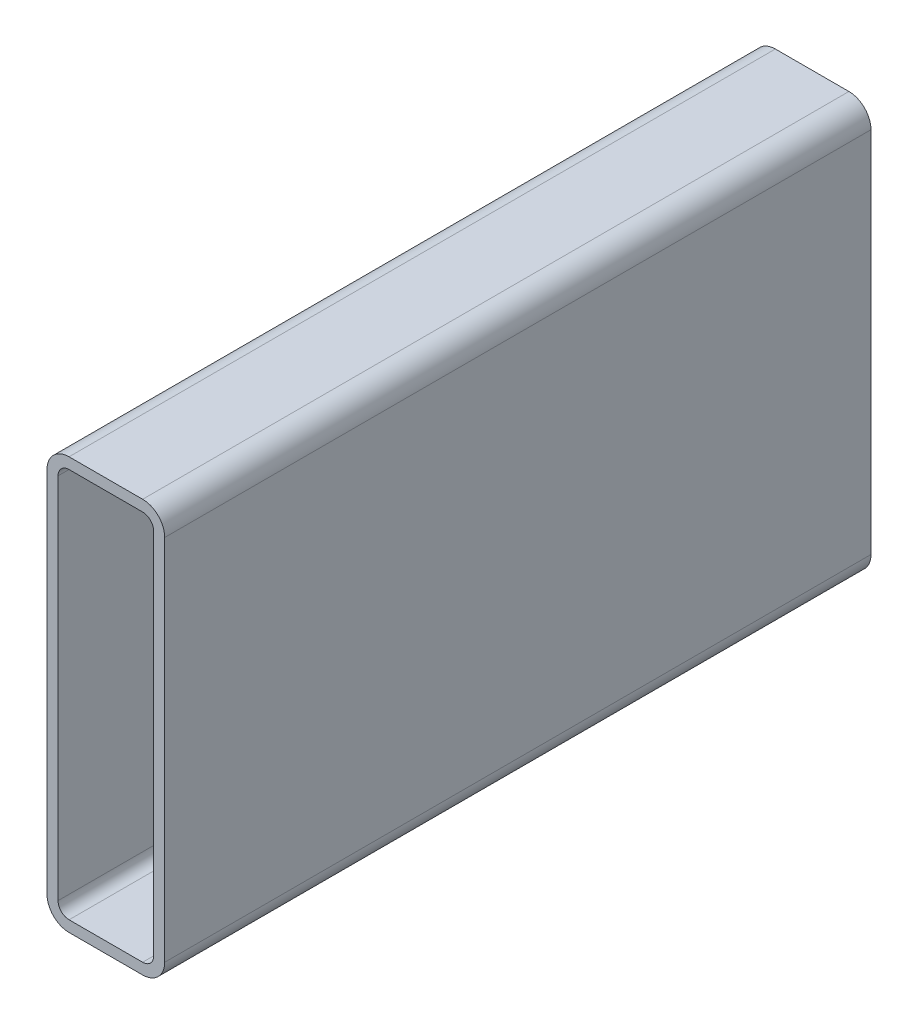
from build123d import *

# Parameters (mm, degrees)
BOSS_EXTRUDE1_DEPTH = 304.8


with BuildPart() as part:
    # Sketch1 → Boss-Extrude1 (new body)
    with BuildSketch(Plane.XY):
        with BuildLine():
            Line((9.525, 177.8), (41.275, 177.8))
            ThreePointArc((41.275, 177.8), (48.010192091, 175.010192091), (50.8, 168.275))
            Line((50.8, 168.275), (50.8, 9.525))
            ThreePointArc((50.8, 9.525), (48.010192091, 2.789807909), (41.275, 0))
            Line((41.275, 0), (9.525, 0))
            ThreePointArc((9.525, 0), (2.789807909, 2.789807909), (0, 9.525))
            Line((0, 9.525), (0, 168.275))
            ThreePointArc((0, 168.275), (2.789807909, 175.010192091), (9.525, 177.8))
        make_face()
        with BuildLine():
            Line((9.525, 173.0375), (41.275, 173.0375))
            ThreePointArc((41.275, 173.0375), (44.642596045, 171.642596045), (46.0375, 168.275))
            Line((46.0375, 168.275), (46.0375, 9.525))
            ThreePointArc((46.0375, 9.525), (44.642596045, 6.157403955), (41.275, 4.7625))
            Line((41.275, 4.7625), (9.525, 4.7625))
            ThreePointArc((9.525, 4.7625), (6.157403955, 6.157403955), (4.7625, 9.525))
            Line((4.7625, 9.525), (4.7625, 168.275))
            ThreePointArc((4.7625, 168.275), (6.157403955, 171.642596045), (9.525, 173.0375))
        make_face(mode=Mode.SUBTRACT)
    extrude(amount=BOSS_EXTRUDE1_DEPTH)


solid = part.part
